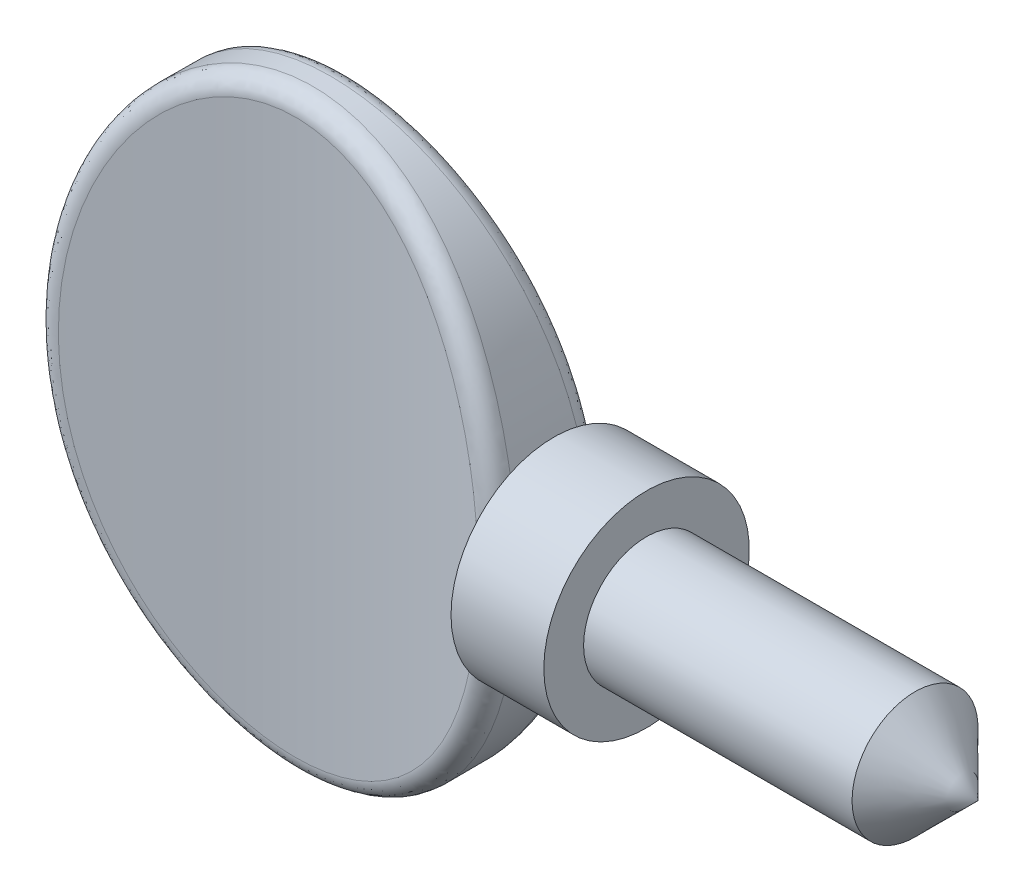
from build123d import *

# Parameters (mm, degrees)
SKETCH1_RX              = 11.303
SKETCH1_RY              = 8.889999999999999
EXTRUDE1_DEPTH          = 2.286
CUT_EXTRUDE1_DEPTH      = 15.560759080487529
CUT_EXTRUDE1_DEPTH_BACK = 15.560759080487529
SKETCH2_OUTSIDE_W       = 25.603999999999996
SKETCH2_OUTSIDE_H       = 12.396
FILLET3_R               = 0.6773333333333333


with BuildPart() as part:
    # Sketch1 → Extrude1 (new, symmetric)
    with BuildSketch(Plane.XY):
        with Locations(Location((0, 0), (0, 0, 90))):
            Ellipse(SKETCH1_RX, SKETCH1_RY)
    extrude(amount=EXTRUDE1_DEPTH, both=True)

    # Sketch2 outside → Cut-Extrude1 (cut, two sides: drawn at the far end of the back side and taken through both)
    with BuildSketch(Plane(origin=(0, 0, 0), x_dir=(1, 0, 0), z_dir=(0, 1, 0)).offset(-CUT_EXTRUDE1_DEPTH_BACK)):
        Rectangle(SKETCH2_OUTSIDE_W, SKETCH2_OUTSIDE_H)
        with BuildLine():
            Line((-8.889999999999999, 2.286), (-8.889999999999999, -2.286))
            ThreePointArc((-8.889999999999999, -2.286), (1.94e-15, -1.0159999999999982), (8.889999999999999, -2.286))
            Line((8.889999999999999, -2.286), (8.889999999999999, 2.286))
            ThreePointArc((8.889999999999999, 2.286), (1.94e-15, 1.0159999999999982), (-8.889999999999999, 2.286))
        make_face(mode=Mode.SUBTRACT)
    extrude(amount=CUT_EXTRUDE1_DEPTH + CUT_EXTRUDE1_DEPTH_BACK, mode=Mode.SUBTRACT)

    # Fillet3
    fillet3_edges = [part.edges().sort_by_distance(p)[0] for p in [
        (-6.499256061e-08, -11.302999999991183, 1.0159999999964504),
        (8.835220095e-08, -11.302999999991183, -1.0159999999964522),
    ]]
    fillet(fillet3_edges, radius=FILLET3_R)

    # Sketch3 → Revolve1 (revolve)
    with BuildSketch(Plane(origin=(0, 0, 0), x_dir=(1, 0, 0), z_dir=(0, 1, 0)), mode=Mode.PRIVATE) as revolve1_sk:
        with BuildLine():
            Line((12.445999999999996, 3.9369999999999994), (12.445999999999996, 2.413))
            Line((12.445999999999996, 2.413), (22.733000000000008, 2.413))
            Line((22.733000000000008, 2.413), (25.145999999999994, 0))
            Line((25.145999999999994, 0), (7.236423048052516, 0))
            Line((7.236423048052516, 0), (7.236423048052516, 1.8516557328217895))
            ThreePointArc((7.236423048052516, 1.8516557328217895), (8.426438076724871, 2.6063068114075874), (8.889999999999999, 3.9370000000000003))
            Line((8.889999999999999, 3.9370000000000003), (12.445999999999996, 3.9369999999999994))
        make_face()
    revolve(revolve1_sk.sketch.rotate(Axis((0, 0, 0), (1, 0, 0)), 180), axis=Axis((0, 0, 0), (1, 0, 0)))


solid = part.part
